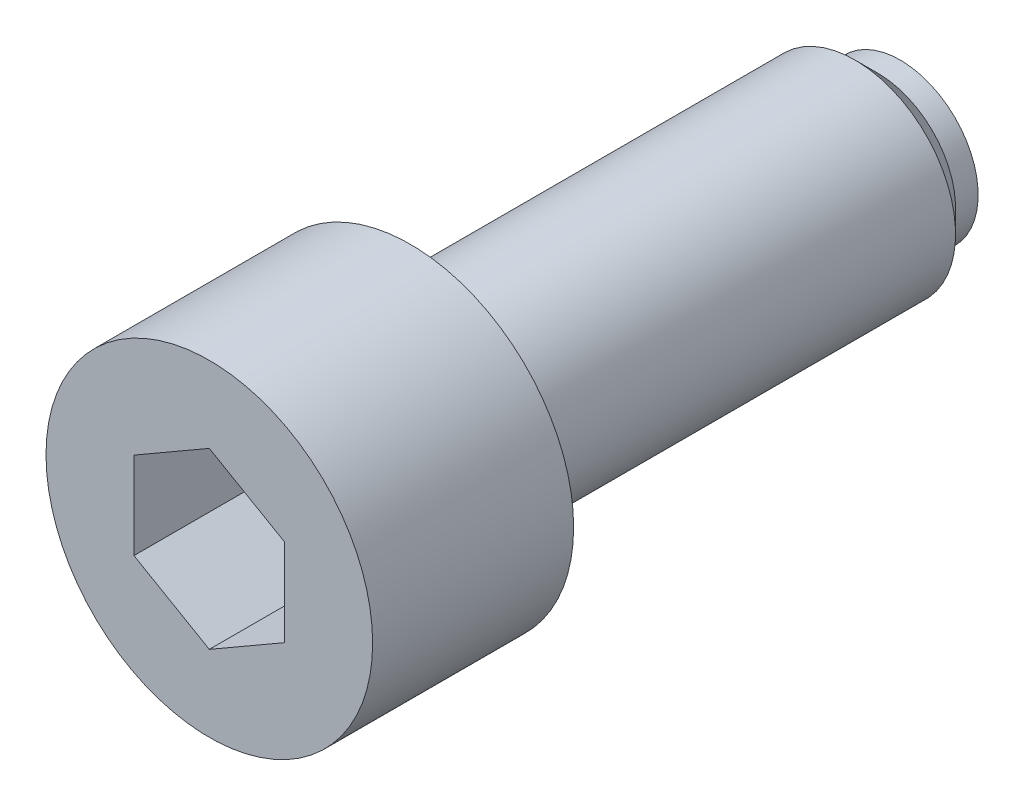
ISO-10303-21;
HEADER;
FILE_DESCRIPTION(('STEP AP214'),'2;1');
FILE_NAME('part.step','',(''),(''),'','','');
FILE_SCHEMA(('AUTOMOTIVE_DESIGN { 1 0 10303 214 1 1 1 1 }'));
ENDSEC;
DATA;
#1=APPLICATION_CONTEXT('core data for automotive mechanical design processes');
#2=APPLICATION_PROTOCOL_DEFINITION('international standard','automotive_design',2000,#1);
#3=PRODUCT_CONTEXT('',#1,'mechanical');
#4=PRODUCT('Part','Part','',(#3));
#5=PRODUCT_RELATED_PRODUCT_CATEGORY('part','',(#4));
#6=PRODUCT_DEFINITION_FORMATION('','',#4);
#7=PRODUCT_DEFINITION_CONTEXT('part definition',#1,'design');
#8=PRODUCT_DEFINITION('design','',#6,#7);
#9=PRODUCT_DEFINITION_SHAPE('','',#8);
#10=(LENGTH_UNIT() NAMED_UNIT(*) SI_UNIT(.MILLI.,.METRE.));
#11=(NAMED_UNIT(*) PLANE_ANGLE_UNIT() SI_UNIT($,.RADIAN.));
#12=(NAMED_UNIT(*) SI_UNIT($,.STERADIAN.) SOLID_ANGLE_UNIT());
#13=UNCERTAINTY_MEASURE_WITH_UNIT(LENGTH_MEASURE(1.E-05),#10,'distance_accuracy_value','');
#14=(GEOMETRIC_REPRESENTATION_CONTEXT(3) GLOBAL_UNCERTAINTY_ASSIGNED_CONTEXT((#13)) GLOBAL_UNIT_ASSIGNED_CONTEXT((#10,
#11,#12)) REPRESENTATION_CONTEXT('',''));
#15=CARTESIAN_POINT('',(0.,0.,0.));
#16=DIRECTION('',(0.,0.,1.));
#17=DIRECTION('',(1.,0.,0.));
#18=AXIS2_PLACEMENT_3D('',#15,#16,#17);
#19=CARTESIAN_POINT('',(0.,0.,0.));
#20=DIRECTION('',(0.,0.,-1.));
#21=DIRECTION('',(-1.,0.,0.));
#22=AXIS2_PLACEMENT_3D('',#19,#20,#21);
#23=PLANE('',#22);
#24=CARTESIAN_POINT('',(0.,0.,0.));
#25=DIRECTION('',(0.,0.,-1.));
#26=DIRECTION('',(-1.,0.,0.));
#27=AXIS2_PLACEMENT_3D('',#24,#25,#26);
#28=CIRCLE('',#27,2.25);
#29=CARTESIAN_POINT('',(-2.25000000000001,0.,0.));
#30=VERTEX_POINT('',#29);
#31=EDGE_CURVE('E132',#30,#30,#28,.T.);
#32=ORIENTED_EDGE('',*,*,#31,.T.);
#33=EDGE_LOOP('',(#32));
#34=FACE_BOUND('',#33,.T.);
#35=ADVANCED_FACE('F16',(#34),#23,.T.);
#36=CARTESIAN_POINT('',(-6.5,0.,28.));
#37=DIRECTION('',(0.,0.,1.));
#38=DIRECTION('',(1.,0.,0.));
#39=AXIS2_PLACEMENT_3D('',#36,#37,#38);
#40=PLANE('',#39);
#41=DIRECTION('',(-0.866025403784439,0.5,0.));
#42=VECTOR('',#41,1.);
#43=CARTESIAN_POINT('',(3.,1.73205080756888,28.));
#44=LINE('',#43,#42);
#45=CARTESIAN_POINT('',(3.,1.73205080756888,28.));
#46=VERTEX_POINT('',#45);
#47=CARTESIAN_POINT('',(0.,3.46410161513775,28.));
#48=VERTEX_POINT('',#47);
#49=EDGE_CURVE('E31',#46,#48,#44,.T.);
#50=ORIENTED_EDGE('',*,*,#49,.F.);
#51=DIRECTION('',(0.,1.,0.));
#52=VECTOR('',#51,1.);
#53=CARTESIAN_POINT('',(3.,-1.73205080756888,28.));
#54=LINE('',#53,#52);
#55=CARTESIAN_POINT('',(3.,-1.73205080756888,28.));
#56=VERTEX_POINT('',#55);
#57=EDGE_CURVE('E126',#56,#46,#54,.T.);
#58=ORIENTED_EDGE('',*,*,#57,.F.);
#59=DIRECTION('',(0.866025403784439,0.5,0.));
#60=VECTOR('',#59,1.);
#61=CARTESIAN_POINT('',(0.,-3.46410161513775,28.));
#62=LINE('',#61,#60);
#63=CARTESIAN_POINT('',(0.,-3.46410161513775,28.));
#64=VERTEX_POINT('',#63);
#65=EDGE_CURVE('E123',#64,#56,#62,.T.);
#66=ORIENTED_EDGE('',*,*,#65,.F.);
#67=DIRECTION('',(0.866025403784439,-0.5,0.));
#68=VECTOR('',#67,1.);
#69=CARTESIAN_POINT('',(-3.,-1.73205080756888,28.));
#70=LINE('',#69,#68);
#71=CARTESIAN_POINT('',(-3.,-1.73205080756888,28.));
#72=VERTEX_POINT('',#71);
#73=EDGE_CURVE('E79',#72,#64,#70,.T.);
#74=ORIENTED_EDGE('',*,*,#73,.F.);
#75=DIRECTION('',(0.,-1.,0.));
#76=VECTOR('',#75,1.);
#77=CARTESIAN_POINT('',(-3.,1.73205080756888,28.));
#78=LINE('',#77,#76);
#79=CARTESIAN_POINT('',(-3.,1.73205080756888,28.));
#80=VERTEX_POINT('',#79);
#81=EDGE_CURVE('E117',#80,#72,#78,.T.);
#82=ORIENTED_EDGE('',*,*,#81,.F.);
#83=DIRECTION('',(-0.866025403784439,-0.5,0.));
#84=VECTOR('',#83,1.);
#85=CARTESIAN_POINT('',(0.,3.46410161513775,28.));
#86=LINE('',#85,#84);
#87=EDGE_CURVE('E113',#48,#80,#86,.T.);
#88=ORIENTED_EDGE('',*,*,#87,.F.);
#89=EDGE_LOOP('',(#50,#58,#66,#74,#82,#88));
#90=FACE_BOUND('',#89,.T.);
#91=CARTESIAN_POINT('',(0.,0.,28.));
#92=DIRECTION('',(0.,0.,-1.));
#93=DIRECTION('',(-1.,0.,0.));
#94=AXIS2_PLACEMENT_3D('',#91,#92,#93);
#95=CIRCLE('',#94,6.5);
#96=CARTESIAN_POINT('',(-6.50000000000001,0.,28.));
#97=VERTEX_POINT('',#96);
#98=EDGE_CURVE('E10',#97,#97,#95,.T.);
#99=ORIENTED_EDGE('',*,*,#98,.F.);
#100=EDGE_LOOP('',(#99));
#101=FACE_BOUND('',#100,.T.);
#102=ADVANCED_FACE('F173',(#90,#101),#40,.T.);
#103=CARTESIAN_POINT('',(0.,0.,0.));
#104=DIRECTION('',(0.,0.,-1.));
#105=DIRECTION('',(-1.,0.,0.));
#106=AXIS2_PLACEMENT_3D('',#103,#104,#105);
#107=CYLINDRICAL_SURFACE('',#106,6.5);
#108=ORIENTED_EDGE('',*,*,#98,.T.);
#109=EDGE_LOOP('',(#108));
#110=FACE_BOUND('',#109,.T.);
#111=CARTESIAN_POINT('',(0.,0.,20.));
#112=DIRECTION('',(0.,0.,-1.));
#113=DIRECTION('',(-1.,0.,0.));
#114=AXIS2_PLACEMENT_3D('',#111,#112,#113);
#115=CIRCLE('',#114,6.5);
#116=CARTESIAN_POINT('',(-6.50000000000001,0.,20.));
#117=VERTEX_POINT('',#116);
#118=EDGE_CURVE('E24',#117,#117,#115,.T.);
#119=ORIENTED_EDGE('',*,*,#118,.F.);
#120=EDGE_LOOP('',(#119));
#121=FACE_BOUND('',#120,.T.);
#122=ADVANCED_FACE('F171',(#110,#121),#107,.T.);
#123=CARTESIAN_POINT('',(-4.,0.,20.));
#124=DIRECTION('',(0.,0.,-1.));
#125=DIRECTION('',(-1.,0.,0.));
#126=AXIS2_PLACEMENT_3D('',#123,#124,#125);
#127=PLANE('',#126);
#128=ORIENTED_EDGE('',*,*,#118,.T.);
#129=EDGE_LOOP('',(#128));
#130=FACE_BOUND('',#129,.T.);
#131=CARTESIAN_POINT('',(0.,0.,20.));
#132=DIRECTION('',(0.,0.,-1.));
#133=DIRECTION('',(-1.,0.,0.));
#134=AXIS2_PLACEMENT_3D('',#131,#132,#133);
#135=CIRCLE('',#134,4.);
#136=CARTESIAN_POINT('',(-4.00000000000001,0.,20.));
#137=VERTEX_POINT('',#136);
#138=EDGE_CURVE('E160',#137,#137,#135,.T.);
#139=ORIENTED_EDGE('',*,*,#138,.F.);
#140=EDGE_LOOP('',(#139));
#141=FACE_BOUND('',#140,.T.);
#142=ADVANCED_FACE('F168',(#130,#141),#127,.T.);
#143=CARTESIAN_POINT('',(0.,0.,0.));
#144=DIRECTION('',(0.,0.,-1.));
#145=DIRECTION('',(-1.,0.,0.));
#146=AXIS2_PLACEMENT_3D('',#143,#144,#145);
#147=CYLINDRICAL_SURFACE('',#146,4.);
#148=ORIENTED_EDGE('',*,*,#138,.T.);
#149=EDGE_LOOP('',(#148));
#150=FACE_BOUND('',#149,.T.);
#151=CARTESIAN_POINT('',(0.,0.,2.3));
#152=DIRECTION('',(0.,0.,-1.));
#153=DIRECTION('',(-1.,0.,0.));
#154=AXIS2_PLACEMENT_3D('',#151,#152,#153);
#155=CIRCLE('',#154,4.);
#156=CARTESIAN_POINT('',(-4.00000000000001,0.,2.3));
#157=VERTEX_POINT('',#156);
#158=EDGE_CURVE('E156',#157,#157,#155,.T.);
#159=ORIENTED_EDGE('',*,*,#158,.F.);
#160=EDGE_LOOP('',(#159));
#161=FACE_BOUND('',#160,.T.);
#162=ADVANCED_FACE('F182',(#150,#161),#147,.T.);
#163=CARTESIAN_POINT('',(0.,0.,1.4));
#164=DIRECTION('',(0.,0.,1.));
#165=DIRECTION('',(1.,0.,0.));
#166=AXIS2_PLACEMENT_3D('',#163,#164,#165);
#167=CONICAL_SURFACE('',#166,3.1,0.785398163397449);
#168=ORIENTED_EDGE('',*,*,#158,.T.);
#169=EDGE_LOOP('',(#168));
#170=FACE_BOUND('',#169,.T.);
#171=CARTESIAN_POINT('',(0.,0.,1.4));
#172=DIRECTION('',(0.,0.,-1.));
#173=DIRECTION('',(-1.,0.,0.));
#174=AXIS2_PLACEMENT_3D('',#171,#172,#173);
#175=CIRCLE('',#174,3.1);
#176=CARTESIAN_POINT('',(-3.10000000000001,0.,1.4));
#177=VERTEX_POINT('',#176);
#178=EDGE_CURVE('E152',#177,#177,#175,.T.);
#179=ORIENTED_EDGE('',*,*,#178,.F.);
#180=EDGE_LOOP('',(#179));
#181=FACE_BOUND('',#180,.T.);
#182=ADVANCED_FACE('F212',(#170,#181),#167,.T.);
#183=CARTESIAN_POINT('',(0.,0.,0.));
#184=DIRECTION('',(0.,0.,-1.));
#185=DIRECTION('',(-1.,0.,0.));
#186=AXIS2_PLACEMENT_3D('',#183,#184,#185);
#187=CYLINDRICAL_SURFACE('',#186,3.1);
#188=ORIENTED_EDGE('',*,*,#178,.T.);
#189=EDGE_LOOP('',(#188));
#190=FACE_BOUND('',#189,.T.);
#191=CARTESIAN_POINT('',(0.,0.,0.5));
#192=DIRECTION('',(0.,0.,-1.));
#193=DIRECTION('',(-1.,0.,0.));
#194=AXIS2_PLACEMENT_3D('',#191,#192,#193);
#195=CIRCLE('',#194,3.1);
#196=CARTESIAN_POINT('',(-3.10000000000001,0.,0.5));
#197=VERTEX_POINT('',#196);
#198=EDGE_CURVE('E149',#197,#197,#195,.T.);
#199=ORIENTED_EDGE('',*,*,#198,.F.);
#200=EDGE_LOOP('',(#199));
#201=FACE_BOUND('',#200,.T.);
#202=ADVANCED_FACE('F205',(#190,#201),#187,.T.);
#203=CARTESIAN_POINT('',(-2.52856457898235,0.,0.5));
#204=DIRECTION('',(0.,0.,-1.));
#205=DIRECTION('',(-1.,0.,0.));
#206=AXIS2_PLACEMENT_3D('',#203,#204,#205);
#207=PLANE('',#206);
#208=ORIENTED_EDGE('',*,*,#198,.T.);
#209=EDGE_LOOP('',(#208));
#210=FACE_BOUND('',#209,.T.);
#211=CARTESIAN_POINT('',(0.,0.,0.5));
#212=DIRECTION('',(0.,0.,-1.));
#213=DIRECTION('',(-1.,0.,0.));
#214=AXIS2_PLACEMENT_3D('',#211,#212,#213);
#215=CIRCLE('',#214,2.52856457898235);
#216=CARTESIAN_POINT('',(-2.52856457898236,0.,0.5));
#217=VERTEX_POINT('',#216);
#218=EDGE_CURVE('E145',#217,#217,#215,.T.);
#219=ORIENTED_EDGE('',*,*,#218,.F.);
#220=EDGE_LOOP('',(#219));
#221=FACE_BOUND('',#220,.T.);
#222=ADVANCED_FACE('F195',(#210,#221),#207,.T.);
#223=CARTESIAN_POINT('',(0.,0.,1.58113883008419));
#224=DIRECTION('',(0.,0.,-1.));
#225=DIRECTION('',(-1.,0.,0.));
#226=AXIS2_PLACEMENT_3D('',#223,#224,#225);
#227=SPHERICAL_SURFACE('',#226,2.75);
#228=CARTESIAN_POINT('',(-2.52856457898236,0.,0.5));
#229=CARTESIAN_POINT('',(-2.52621637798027,0.,0.494508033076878));
#230=CARTESIAN_POINT('',(-2.52385028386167,0.,0.489023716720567));
#231=CARTESIAN_POINT('',(-2.51908241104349,0.,0.478070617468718));
#232=CARTESIAN_POINT('',(-2.5166806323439,0.,0.472601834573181));
#233=CARTESIAN_POINT('',(-2.51184149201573,0.,0.461680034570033));
#234=CARTESIAN_POINT('',(-2.50940413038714,0.,0.456227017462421));
#235=CARTESIAN_POINT('',(-2.50449392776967,0.,0.445336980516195));
#236=CARTESIAN_POINT('',(-2.5020210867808,0.,0.43989996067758));
#237=CARTESIAN_POINT('',(-2.49704003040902,0.,0.429042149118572));
#238=CARTESIAN_POINT('',(-2.49453181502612,0.,0.42362135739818));
#239=CARTESIAN_POINT('',(-2.4894801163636,0.,0.41279623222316));
#240=CARTESIAN_POINT('',(-2.48693663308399,0.,0.407391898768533));
#241=CARTESIAN_POINT('',(-2.48181450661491,0.,0.396599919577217));
#242=CARTESIAN_POINT('',(-2.47923586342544,0.,0.391212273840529));
#243=CARTESIAN_POINT('',(-2.4740435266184,0.,0.380453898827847));
#244=CARTESIAN_POINT('',(-2.47142983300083,0.,0.375083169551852));
#245=CARTESIAN_POINT('',(-2.46616750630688,0.,0.364358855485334));
#246=CARTESIAN_POINT('',(-2.46351887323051,0.,0.35900527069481));
#247=CARTESIAN_POINT('',(-2.45818678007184,0.,0.348315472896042));
#248=CARTESIAN_POINT('',(-2.45550331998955,0.,0.342979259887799));
#249=CARTESIAN_POINT('',(-2.45010168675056,0.,0.332324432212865));
#250=CARTESIAN_POINT('',(-2.44738351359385,0.,0.327005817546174));
#251=CARTESIAN_POINT('',(-2.44191256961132,0.,0.316386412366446));
#252=CARTESIAN_POINT('',(-2.4391597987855,0.,0.311085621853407));
#253=CARTESIAN_POINT('',(-2.43361977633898,0.,0.300502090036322));
#254=CARTESIAN_POINT('',(-2.43083252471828,0.,0.295219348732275));
#255=CARTESIAN_POINT('',(-2.42522365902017,0.,0.284672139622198));
#256=CARTESIAN_POINT('',(-2.42240204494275,0.,0.279407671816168));
#257=CARTESIAN_POINT('',(-2.41672457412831,0.,0.268897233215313));
#258=CARTESIAN_POINT('',(-2.41386871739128,0.,0.263651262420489));
#259=CARTESIAN_POINT('',(-2.40812288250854,0.,0.253178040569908));
#260=CARTESIAN_POINT('',(-2.40523290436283,0.,0.247950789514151));
#261=CARTESIAN_POINT('',(-2.39941894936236,0.,0.237515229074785));
#262=CARTESIAN_POINT('',(-2.39649497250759,0.,0.232306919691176));
#263=CARTESIAN_POINT('',(-2.39061314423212,0.,0.221909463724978));
#264=CARTESIAN_POINT('',(-2.38765529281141,0.,0.21672031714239));
#265=CARTESIAN_POINT('',(-2.38170584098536,0.,0.206361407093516));
#266=CARTESIAN_POINT('',(-2.37871424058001,0.,0.201191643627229));
#267=CARTESIAN_POINT('',(-2.3726974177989,0.,0.190871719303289));
#268=CARTESIAN_POINT('',(-2.36967219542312,0.,0.185721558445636));
#269=CARTESIAN_POINT('',(-2.36358825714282,0.,0.175441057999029));
#270=CARTESIAN_POINT('',(-2.3605295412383,0.,0.170310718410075));
#271=CARTESIAN_POINT('',(-2.35437874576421,0.,0.160070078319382));
#272=CARTESIAN_POINT('',(-2.35128666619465,0.,0.154959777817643));
#273=CARTESIAN_POINT('',(-2.34506927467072,0.,0.144759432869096));
#274=CARTESIAN_POINT('',(-2.34194396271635,0.,0.139669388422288));
#275=CARTESIAN_POINT('',(-2.335660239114,0.,0.129509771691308));
#276=CARTESIAN_POINT('',(-2.33250182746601,0.,0.124440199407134));
#277=CARTESIAN_POINT('',(-2.32615203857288,0.,0.114321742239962));
#278=CARTESIAN_POINT('',(-2.32296066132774,0.,0.109272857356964));
#279=CARTESIAN_POINT('',(-2.31654507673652,0.,0.0991959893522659));
#280=CARTESIAN_POINT('',(-2.31332086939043,0.,0.0941680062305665));
#281=CARTESIAN_POINT('',(-2.30683976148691,0.,0.0841331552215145));
#282=CARTESIAN_POINT('',(-2.30358286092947,0.,0.0791262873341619));
#283=CARTESIAN_POINT('',(-2.29703650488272,0.,0.0691338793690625));
#284=CARTESIAN_POINT('',(-2.29374704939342,0.,0.0641483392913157));
#285=CARTESIAN_POINT('',(-2.28713572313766,0.,0.0541987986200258));
#286=CARTESIAN_POINT('',(-2.2838138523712,0.,0.0492347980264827));
#287=CARTESIAN_POINT('',(-2.27713783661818,0.,0.0393285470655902));
#288=CARTESIAN_POINT('',(-2.27378369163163,0.,0.0343862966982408));
#289=CARTESIAN_POINT('',(-2.26704326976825,0.,0.024523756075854));
#290=CARTESIAN_POINT('',(-2.26365699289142,0.,0.0196034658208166));
#291=CARTESIAN_POINT('',(-2.25685245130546,0.,0.00978505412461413));
#292=CARTESIAN_POINT('',(-2.25343418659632,0.,0.004886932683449));
#293=CARTESIAN_POINT('',(-2.25000000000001,0.,0.));
#294=B_SPLINE_CURVE_WITH_KNOTS('',3,(#228,#229,#230,#231,#232,#233,#234,#235,#236,#237,#238,
#239,#240,#241,#242,#243,#244,#245,#246,#247,#248,#249,#250,#251,#252,#253,#254,#255,#256,#257,
#258,#259,#260,#261,#262,#263,#264,#265,#266,#267,#268,#269,#270,#271,#272,#273,#274,#275,#276,
#277,#278,#279,#280,#281,#282,#283,#284,#285,#286,#287,#288,#289,#290,#291,#292,#293),
.UNSPECIFIED.,.F.,.F.,(4,2,2,2,2,2,2,2,2,2,2,2,2,2,2,2,2,2,2,2,2,2,2,2,2,2,2,2,2,2,2,2,4),(0.,
0.0179187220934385,0.035837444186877,0.0537561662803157,0.0716748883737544,0.0895936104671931,
0.107512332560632,0.12543105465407,0.143349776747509,0.161268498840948,0.179187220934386,
0.197105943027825,0.215024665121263,0.232943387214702,0.250862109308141,0.268780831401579,
0.286699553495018,0.304618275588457,0.322536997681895,0.340455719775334,0.358374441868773,
0.376293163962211,0.39421188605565,0.412130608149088,0.430049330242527,0.447968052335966,
0.465886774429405,0.483805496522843,0.501724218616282,0.519642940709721,0.537561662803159,
0.555480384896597,0.573399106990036),.UNSPECIFIED.);
#295=EDGE_CURVE('BSEAM192',#217,#30,#294,.T.);
#296=ORIENTED_EDGE('',*,*,#218,.T.);
#297=ORIENTED_EDGE('',*,*,#31,.F.);
#298=ORIENTED_EDGE('',*,*,#295,.T.);
#299=ORIENTED_EDGE('',*,*,#295,.F.);
#300=EDGE_LOOP('',(#296,#298,#297,#299));
#301=FACE_BOUND('',#300,.T.);
#302=ADVANCED_FACE('F192',(#301),#227,.T.);
#303=CARTESIAN_POINT('',(3.,1.73205080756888,23.));
#304=DIRECTION('',(0.5,0.866025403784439,0.));
#305=DIRECTION('',(-0.866025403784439,0.5,0.));
#306=AXIS2_PLACEMENT_3D('',#303,#304,#305);
#307=PLANE('',#306);
#308=ORIENTED_EDGE('',*,*,#49,.T.);
#309=DIRECTION('',(0.,0.,1.));
#310=VECTOR('',#309,1.);
#311=CARTESIAN_POINT('',(0.,3.46410161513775,23.));
#312=LINE('',#311,#310);
#313=CARTESIAN_POINT('',(0.,3.46410161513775,23.));
#314=VERTEX_POINT('',#313);
#315=EDGE_CURVE('E61',#314,#48,#312,.T.);
#316=ORIENTED_EDGE('',*,*,#315,.F.);
#317=DIRECTION('',(-0.866025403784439,0.5,0.));
#318=VECTOR('',#317,1.);
#319=CARTESIAN_POINT('',(3.,1.73205080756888,23.));
#320=LINE('',#319,#318);
#321=CARTESIAN_POINT('',(3.,1.73205080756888,23.));
#322=VERTEX_POINT('',#321);
#323=EDGE_CURVE('E129',#322,#314,#320,.T.);
#324=ORIENTED_EDGE('',*,*,#323,.F.);
#325=DIRECTION('',(0.,0.,1.));
#326=VECTOR('',#325,1.);
#327=CARTESIAN_POINT('',(3.,1.73205080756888,23.));
#328=LINE('',#327,#326);
#329=EDGE_CURVE('E39',#322,#46,#328,.T.);
#330=ORIENTED_EDGE('',*,*,#329,.T.);
#331=EDGE_LOOP('',(#308,#316,#324,#330));
#332=FACE_BOUND('',#331,.T.);
#333=ADVANCED_FACE('F194',(#332),#307,.F.);
#334=CARTESIAN_POINT('',(3.,-1.73205080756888,23.));
#335=DIRECTION('',(1.,0.,0.));
#336=DIRECTION('',(0.,0.,-1.));
#337=AXIS2_PLACEMENT_3D('',#334,#335,#336);
#338=PLANE('',#337);
#339=ORIENTED_EDGE('',*,*,#57,.T.);
#340=ORIENTED_EDGE('',*,*,#329,.F.);
#341=DIRECTION('',(0.,1.,0.));
#342=VECTOR('',#341,1.);
#343=CARTESIAN_POINT('',(3.,-1.73205080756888,23.));
#344=LINE('',#343,#342);
#345=CARTESIAN_POINT('',(3.,-1.73205080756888,23.));
#346=VERTEX_POINT('',#345);
#347=EDGE_CURVE('E93',#346,#322,#344,.T.);
#348=ORIENTED_EDGE('',*,*,#347,.F.);
#349=DIRECTION('',(0.,0.,1.));
#350=VECTOR('',#349,1.);
#351=CARTESIAN_POINT('',(3.,-1.73205080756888,23.));
#352=LINE('',#351,#350);
#353=EDGE_CURVE('E84',#346,#56,#352,.T.);
#354=ORIENTED_EDGE('',*,*,#353,.T.);
#355=EDGE_LOOP('',(#339,#340,#348,#354));
#356=FACE_BOUND('',#355,.T.);
#357=ADVANCED_FACE('F203',(#356),#338,.F.);
#358=CARTESIAN_POINT('',(0.,-3.46410161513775,23.));
#359=DIRECTION('',(0.5,-0.866025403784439,0.));
#360=DIRECTION('',(0.866025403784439,0.5,0.));
#361=AXIS2_PLACEMENT_3D('',#358,#359,#360);
#362=PLANE('',#361);
#363=ORIENTED_EDGE('',*,*,#65,.T.);
#364=ORIENTED_EDGE('',*,*,#353,.F.);
#365=DIRECTION('',(0.866025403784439,0.5,0.));
#366=VECTOR('',#365,1.);
#367=CARTESIAN_POINT('',(0.,-3.46410161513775,23.));
#368=LINE('',#367,#366);
#369=CARTESIAN_POINT('',(0.,-3.46410161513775,23.));
#370=VERTEX_POINT('',#369);
#371=EDGE_CURVE('E88',#370,#346,#368,.T.);
#372=ORIENTED_EDGE('',*,*,#371,.F.);
#373=DIRECTION('',(0.,0.,1.));
#374=VECTOR('',#373,1.);
#375=CARTESIAN_POINT('',(0.,-3.46410161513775,23.));
#376=LINE('',#375,#374);
#377=EDGE_CURVE('E72',#370,#64,#376,.T.);
#378=ORIENTED_EDGE('',*,*,#377,.T.);
#379=EDGE_LOOP('',(#363,#364,#372,#378));
#380=FACE_BOUND('',#379,.T.);
#381=ADVANCED_FACE('F89',(#380),#362,.F.);
#382=CARTESIAN_POINT('',(-3.,-1.73205080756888,23.));
#383=DIRECTION('',(-0.5,-0.866025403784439,0.));
#384=DIRECTION('',(0.866025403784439,-0.5,0.));
#385=AXIS2_PLACEMENT_3D('',#382,#383,#384);
#386=PLANE('',#385);
#387=ORIENTED_EDGE('',*,*,#73,.T.);
#388=ORIENTED_EDGE('',*,*,#377,.F.);
#389=DIRECTION('',(0.866025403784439,-0.5,0.));
#390=VECTOR('',#389,1.);
#391=CARTESIAN_POINT('',(-3.,-1.73205080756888,23.));
#392=LINE('',#391,#390);
#393=CARTESIAN_POINT('',(-3.,-1.73205080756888,23.));
#394=VERTEX_POINT('',#393);
#395=EDGE_CURVE('E76',#394,#370,#392,.T.);
#396=ORIENTED_EDGE('',*,*,#395,.F.);
#397=DIRECTION('',(0.,0.,1.));
#398=VECTOR('',#397,1.);
#399=CARTESIAN_POINT('',(-3.,-1.73205080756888,23.));
#400=LINE('',#399,#398);
#401=EDGE_CURVE('E85',#394,#72,#400,.T.);
#402=ORIENTED_EDGE('',*,*,#401,.T.);
#403=EDGE_LOOP('',(#387,#388,#396,#402));
#404=FACE_BOUND('',#403,.T.);
#405=ADVANCED_FACE('F74',(#404),#386,.F.);
#406=CARTESIAN_POINT('',(-3.,1.73205080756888,23.));
#407=DIRECTION('',(-1.,0.,0.));
#408=DIRECTION('',(0.,0.,1.));
#409=AXIS2_PLACEMENT_3D('',#406,#407,#408);
#410=PLANE('',#409);
#411=ORIENTED_EDGE('',*,*,#81,.T.);
#412=ORIENTED_EDGE('',*,*,#401,.F.);
#413=DIRECTION('',(0.,-1.,0.));
#414=VECTOR('',#413,1.);
#415=CARTESIAN_POINT('',(-3.,1.73205080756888,23.));
#416=LINE('',#415,#414);
#417=CARTESIAN_POINT('',(-3.,1.73205080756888,23.));
#418=VERTEX_POINT('',#417);
#419=EDGE_CURVE('E99',#418,#394,#416,.T.);
#420=ORIENTED_EDGE('',*,*,#419,.F.);
#421=DIRECTION('',(0.,0.,1.));
#422=VECTOR('',#421,1.);
#423=CARTESIAN_POINT('',(-3.,1.73205080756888,23.));
#424=LINE('',#423,#422);
#425=EDGE_CURVE('E137',#418,#80,#424,.T.);
#426=ORIENTED_EDGE('',*,*,#425,.T.);
#427=EDGE_LOOP('',(#411,#412,#420,#426));
#428=FACE_BOUND('',#427,.T.);
#429=ADVANCED_FACE('F305',(#428),#410,.F.);
#430=CARTESIAN_POINT('',(0.,3.46410161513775,23.));
#431=DIRECTION('',(-0.5,0.866025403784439,0.));
#432=DIRECTION('',(-0.866025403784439,-0.5,0.));
#433=AXIS2_PLACEMENT_3D('',#430,#431,#432);
#434=PLANE('',#433);
#435=ORIENTED_EDGE('',*,*,#87,.T.);
#436=ORIENTED_EDGE('',*,*,#425,.F.);
#437=DIRECTION('',(-0.866025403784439,-0.5,0.));
#438=VECTOR('',#437,1.);
#439=CARTESIAN_POINT('',(0.,3.46410161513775,23.));
#440=LINE('',#439,#438);
#441=EDGE_CURVE('E105',#314,#418,#440,.T.);
#442=ORIENTED_EDGE('',*,*,#441,.F.);
#443=ORIENTED_EDGE('',*,*,#315,.T.);
#444=EDGE_LOOP('',(#435,#436,#442,#443));
#445=FACE_BOUND('',#444,.T.);
#446=ADVANCED_FACE('F313',(#445),#434,.F.);
#447=CARTESIAN_POINT('',(0.,0.,23.));
#448=DIRECTION('',(0.,0.,1.));
#449=DIRECTION('',(1.,0.,0.));
#450=AXIS2_PLACEMENT_3D('',#447,#448,#449);
#451=PLANE('',#450);
#452=ORIENTED_EDGE('',*,*,#323,.T.);
#453=ORIENTED_EDGE('',*,*,#441,.T.);
#454=ORIENTED_EDGE('',*,*,#419,.T.);
#455=ORIENTED_EDGE('',*,*,#395,.T.);
#456=ORIENTED_EDGE('',*,*,#371,.T.);
#457=ORIENTED_EDGE('',*,*,#347,.T.);
#458=EDGE_LOOP('',(#452,#453,#454,#455,#456,#457));
#459=FACE_BOUND('',#458,.T.);
#460=ADVANCED_FACE('F96',(#459),#451,.T.);
#461=CLOSED_SHELL('',(#35,#102,#122,#142,#162,#182,#202,#222,#302,#333,#357,#381,#405,#429,#446,#460));
#462=MANIFOLD_SOLID_BREP('B1',#461);
#463=ADVANCED_BREP_SHAPE_REPRESENTATION('',(#18,#462),#14);
#464=SHAPE_DEFINITION_REPRESENTATION(#9,#463);
ENDSEC;
END-ISO-10303-21;
